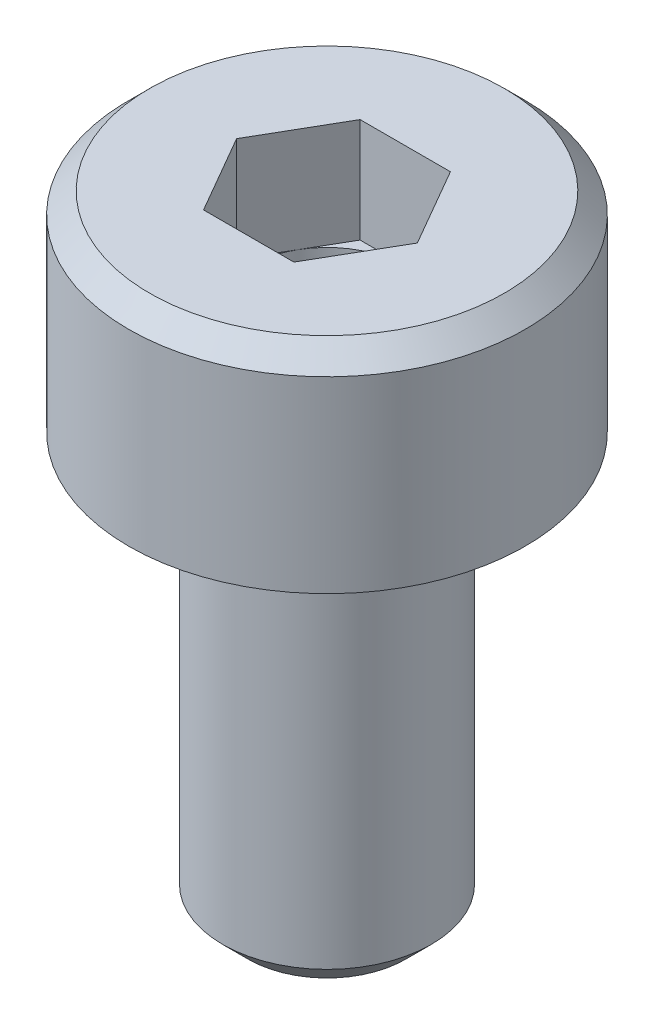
ISO-10303-21;
HEADER;
FILE_DESCRIPTION(('STEP AP214'),'2;1');
FILE_NAME('part.step','',(''),(''),'','','');
FILE_SCHEMA(('AUTOMOTIVE_DESIGN { 1 0 10303 214 1 1 1 1 }'));
ENDSEC;
DATA;
#1=APPLICATION_CONTEXT('core data for automotive mechanical design processes');
#2=APPLICATION_PROTOCOL_DEFINITION('international standard','automotive_design',2000,#1);
#3=PRODUCT_CONTEXT('',#1,'mechanical');
#4=PRODUCT('Part','Part','',(#3));
#5=PRODUCT_RELATED_PRODUCT_CATEGORY('part','',(#4));
#6=PRODUCT_DEFINITION_FORMATION('','',#4);
#7=PRODUCT_DEFINITION_CONTEXT('part definition',#1,'design');
#8=PRODUCT_DEFINITION('design','',#6,#7);
#9=PRODUCT_DEFINITION_SHAPE('','',#8);
#10=(LENGTH_UNIT() NAMED_UNIT(*) SI_UNIT(.MILLI.,.METRE.));
#11=(NAMED_UNIT(*) PLANE_ANGLE_UNIT() SI_UNIT($,.RADIAN.));
#12=(NAMED_UNIT(*) SI_UNIT($,.STERADIAN.) SOLID_ANGLE_UNIT());
#13=UNCERTAINTY_MEASURE_WITH_UNIT(LENGTH_MEASURE(1.E-05),#10,'distance_accuracy_value','');
#14=(GEOMETRIC_REPRESENTATION_CONTEXT(3) GLOBAL_UNCERTAINTY_ASSIGNED_CONTEXT((#13)) GLOBAL_UNIT_ASSIGNED_CONTEXT((#10,
#11,#12)) REPRESENTATION_CONTEXT('',''));
#15=CARTESIAN_POINT('',(0.,0.,0.));
#16=DIRECTION('',(0.,0.,1.));
#17=DIRECTION('',(1.,0.,0.));
#18=AXIS2_PLACEMENT_3D('',#15,#16,#17);
#19=CARTESIAN_POINT('',(0.,0.550000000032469,0.));
#20=DIRECTION('',(0.,1.,0.));
#21=DIRECTION('',(0.,0.,1.));
#22=AXIS2_PLACEMENT_3D('',#19,#20,#21);
#23=CONICAL_SURFACE('',#22,0.750000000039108,1.04719755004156);
#24=CARTESIAN_POINT('',(0.,0.116987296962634,0.));
#25=VERTEX_POINT('',#24);
#26=VERTEX_LOOP('',#25);
#27=FACE_BOUND('',#26,.T.);
#28=CARTESIAN_POINT('',(0.,0.55,0.));
#29=DIRECTION('',(0.,-1.,0.));
#30=DIRECTION('',(0.,0.,-1.));
#31=AXIS2_PLACEMENT_3D('',#28,#29,#30);
#32=CIRCLE('',#31,0.75);
#33=CARTESIAN_POINT('',(0.,0.55,-0.75));
#34=VERTEX_POINT('',#33);
#35=EDGE_CURVE('E98',#34,#34,#32,.F.);
#36=ORIENTED_EDGE('',*,*,#35,.T.);
#37=EDGE_LOOP('',(#36));
#38=FACE_BOUND('',#37,.T.);
#39=ADVANCED_FACE('F16',(#27,#38),#23,.F.);
#40=CARTESIAN_POINT('',(0.,2.,0.));
#41=DIRECTION('',(0.,-1.,0.));
#42=DIRECTION('',(0.,0.,-1.));
#43=AXIS2_PLACEMENT_3D('',#40,#41,#42);
#44=CYLINDRICAL_SURFACE('',#43,0.75);
#45=CARTESIAN_POINT('',(0.,1.,0.));
#46=DIRECTION('',(0.,-1.,0.));
#47=DIRECTION('',(0.,0.,-1.));
#48=AXIS2_PLACEMENT_3D('',#45,#46,#47);
#49=CIRCLE('',#48,0.75);
#50=CARTESIAN_POINT('',(0.,1.,-0.75));
#51=VERTEX_POINT('',#50);
#52=CARTESIAN_POINT('',(-0.649519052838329,1.,-0.375));
#53=VERTEX_POINT('',#52);
#54=EDGE_CURVE('E19',#51,#53,#49,.F.);
#55=ORIENTED_EDGE('',*,*,#54,.T.);
#56=CARTESIAN_POINT('',(0.,1.,0.));
#57=DIRECTION('',(0.,-1.,0.));
#58=DIRECTION('',(0.,0.,-1.));
#59=AXIS2_PLACEMENT_3D('',#56,#57,#58);
#60=CIRCLE('',#59,0.75);
#61=CARTESIAN_POINT('',(-0.649519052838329,1.,0.375));
#62=VERTEX_POINT('',#61);
#63=EDGE_CURVE('E93',#53,#62,#60,.F.);
#64=ORIENTED_EDGE('',*,*,#63,.T.);
#65=CARTESIAN_POINT('',(0.,1.,0.));
#66=DIRECTION('',(0.,-1.,0.));
#67=DIRECTION('',(0.,0.,-1.));
#68=AXIS2_PLACEMENT_3D('',#65,#66,#67);
#69=CIRCLE('',#68,0.75);
#70=CARTESIAN_POINT('',(0.,1.,0.75));
#71=VERTEX_POINT('',#70);
#72=EDGE_CURVE('E108',#62,#71,#69,.F.);
#73=ORIENTED_EDGE('',*,*,#72,.T.);
#74=CARTESIAN_POINT('',(0.,1.,0.));
#75=DIRECTION('',(0.,-1.,0.));
#76=DIRECTION('',(0.,0.,-1.));
#77=AXIS2_PLACEMENT_3D('',#74,#75,#76);
#78=CIRCLE('',#77,0.75);
#79=CARTESIAN_POINT('',(0.649519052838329,1.,0.375));
#80=VERTEX_POINT('',#79);
#81=EDGE_CURVE('E217',#71,#80,#78,.F.);
#82=ORIENTED_EDGE('',*,*,#81,.T.);
#83=CARTESIAN_POINT('',(0.,1.,0.));
#84=DIRECTION('',(0.,-1.,0.));
#85=DIRECTION('',(0.,0.,-1.));
#86=AXIS2_PLACEMENT_3D('',#83,#84,#85);
#87=CIRCLE('',#86,0.75);
#88=CARTESIAN_POINT('',(0.649519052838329,1.,-0.375));
#89=VERTEX_POINT('',#88);
#90=EDGE_CURVE('E219',#80,#89,#87,.F.);
#91=ORIENTED_EDGE('',*,*,#90,.T.);
#92=CARTESIAN_POINT('',(0.,1.,0.));
#93=DIRECTION('',(0.,-1.,0.));
#94=DIRECTION('',(0.,0.,-1.));
#95=AXIS2_PLACEMENT_3D('',#92,#93,#94);
#96=CIRCLE('',#95,0.75);
#97=EDGE_CURVE('E88',#89,#51,#96,.F.);
#98=ORIENTED_EDGE('',*,*,#97,.T.);
#99=EDGE_LOOP('',(#55,#64,#73,#82,#91,#98));
#100=FACE_BOUND('',#99,.T.);
#101=ORIENTED_EDGE('',*,*,#35,.F.);
#102=EDGE_LOOP('',(#101));
#103=FACE_BOUND('',#102,.T.);
#104=ADVANCED_FACE('F91',(#100,#103),#44,.F.);
#105=CARTESIAN_POINT('',(0.,1.,0.));
#106=DIRECTION('',(0.,-1.,0.));
#107=DIRECTION('',(0.,0.,-1.));
#108=AXIS2_PLACEMENT_3D('',#105,#106,#107);
#109=PLANE('',#108);
#110=DIRECTION('',(-0.5,0.,0.866025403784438));
#111=VECTOR('',#110,1.);
#112=CARTESIAN_POINT('',(-0.649519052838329,1.,-0.375));
#113=LINE('',#112,#111);
#114=CARTESIAN_POINT('',(-0.433012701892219,1.,-0.75));
#115=VERTEX_POINT('',#114);
#116=EDGE_CURVE('E111',#115,#53,#113,.T.);
#117=ORIENTED_EDGE('',*,*,#116,.T.);
#118=ORIENTED_EDGE('',*,*,#54,.F.);
#119=DIRECTION('',(-1.,0.,0.));
#120=VECTOR('',#119,1.);
#121=CARTESIAN_POINT('',(0.,1.,-0.75));
#122=LINE('',#121,#120);
#123=EDGE_CURVE('E114',#51,#115,#122,.T.);
#124=ORIENTED_EDGE('',*,*,#123,.T.);
#125=EDGE_LOOP('',(#117,#118,#124));
#126=FACE_BOUND('',#125,.T.);
#127=ADVANCED_FACE('F112',(#126),#109,.F.);
#128=CARTESIAN_POINT('',(0.,1.,0.));
#129=DIRECTION('',(0.,-1.,0.));
#130=DIRECTION('',(0.,0.,-1.));
#131=AXIS2_PLACEMENT_3D('',#128,#129,#130);
#132=PLANE('',#131);
#133=DIRECTION('',(-1.,0.,0.));
#134=VECTOR('',#133,1.);
#135=CARTESIAN_POINT('',(0.,1.,-0.75));
#136=LINE('',#135,#134);
#137=CARTESIAN_POINT('',(0.43301270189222,1.,-0.75));
#138=VERTEX_POINT('',#137);
#139=EDGE_CURVE('E183',#138,#51,#136,.T.);
#140=ORIENTED_EDGE('',*,*,#139,.T.);
#141=ORIENTED_EDGE('',*,*,#97,.F.);
#142=DIRECTION('',(0.5,0.,0.866025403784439));
#143=VECTOR('',#142,1.);
#144=CARTESIAN_POINT('',(0.649519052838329,1.,-0.375));
#145=LINE('',#144,#143);
#146=EDGE_CURVE('E174',#138,#89,#145,.T.);
#147=ORIENTED_EDGE('',*,*,#146,.F.);
#148=EDGE_LOOP('',(#140,#141,#147));
#149=FACE_BOUND('',#148,.T.);
#150=ADVANCED_FACE('F226',(#149),#132,.F.);
#151=CARTESIAN_POINT('',(0.,1.,0.));
#152=DIRECTION('',(0.,-1.,0.));
#153=DIRECTION('',(0.,0.,-1.));
#154=AXIS2_PLACEMENT_3D('',#151,#152,#153);
#155=PLANE('',#154);
#156=DIRECTION('',(0.5,0.,0.866025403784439));
#157=VECTOR('',#156,1.);
#158=CARTESIAN_POINT('',(0.649519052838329,1.,-0.375));
#159=LINE('',#158,#157);
#160=CARTESIAN_POINT('',(0.866025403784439,1.,0.));
#161=VERTEX_POINT('',#160);
#162=EDGE_CURVE('E171',#89,#161,#159,.T.);
#163=ORIENTED_EDGE('',*,*,#162,.F.);
#164=ORIENTED_EDGE('',*,*,#90,.F.);
#165=DIRECTION('',(-0.5,0.,0.866025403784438));
#166=VECTOR('',#165,1.);
#167=CARTESIAN_POINT('',(0.649519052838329,1.,0.375));
#168=LINE('',#167,#166);
#169=EDGE_CURVE('E159',#161,#80,#168,.T.);
#170=ORIENTED_EDGE('',*,*,#169,.F.);
#171=EDGE_LOOP('',(#163,#164,#170));
#172=FACE_BOUND('',#171,.T.);
#173=ADVANCED_FACE('F228',(#172),#155,.F.);
#174=CARTESIAN_POINT('',(0.,1.,0.));
#175=DIRECTION('',(0.,-1.,0.));
#176=DIRECTION('',(0.,0.,-1.));
#177=AXIS2_PLACEMENT_3D('',#174,#175,#176);
#178=PLANE('',#177);
#179=DIRECTION('',(-0.5,0.,0.866025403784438));
#180=VECTOR('',#179,1.);
#181=CARTESIAN_POINT('',(0.649519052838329,1.,0.375));
#182=LINE('',#181,#180);
#183=CARTESIAN_POINT('',(0.433012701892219,1.,0.75));
#184=VERTEX_POINT('',#183);
#185=EDGE_CURVE('E156',#80,#184,#182,.T.);
#186=ORIENTED_EDGE('',*,*,#185,.F.);
#187=ORIENTED_EDGE('',*,*,#81,.F.);
#188=DIRECTION('',(-1.,0.,0.));
#189=VECTOR('',#188,1.);
#190=CARTESIAN_POINT('',(0.,1.,0.75));
#191=LINE('',#190,#189);
#192=EDGE_CURVE('E144',#184,#71,#191,.T.);
#193=ORIENTED_EDGE('',*,*,#192,.F.);
#194=EDGE_LOOP('',(#186,#187,#193));
#195=FACE_BOUND('',#194,.T.);
#196=ADVANCED_FACE('F265',(#195),#178,.F.);
#197=CARTESIAN_POINT('',(0.,1.,0.));
#198=DIRECTION('',(0.,-1.,0.));
#199=DIRECTION('',(0.,0.,-1.));
#200=AXIS2_PLACEMENT_3D('',#197,#198,#199);
#201=PLANE('',#200);
#202=DIRECTION('',(-1.,0.,0.));
#203=VECTOR('',#202,1.);
#204=CARTESIAN_POINT('',(0.,1.,0.75));
#205=LINE('',#204,#203);
#206=CARTESIAN_POINT('',(-0.433012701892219,1.,0.75));
#207=VERTEX_POINT('',#206);
#208=EDGE_CURVE('E141',#71,#207,#205,.T.);
#209=ORIENTED_EDGE('',*,*,#208,.F.);
#210=ORIENTED_EDGE('',*,*,#72,.F.);
#211=DIRECTION('',(0.5,0.,0.866025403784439));
#212=VECTOR('',#211,1.);
#213=CARTESIAN_POINT('',(-0.649519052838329,1.,0.375));
#214=LINE('',#213,#212);
#215=EDGE_CURVE('E148',#62,#207,#214,.T.);
#216=ORIENTED_EDGE('',*,*,#215,.T.);
#217=EDGE_LOOP('',(#209,#210,#216));
#218=FACE_BOUND('',#217,.T.);
#219=ADVANCED_FACE('F262',(#218),#201,.F.);
#220=CARTESIAN_POINT('',(0.,1.,0.));
#221=DIRECTION('',(0.,-1.,0.));
#222=DIRECTION('',(0.,0.,-1.));
#223=AXIS2_PLACEMENT_3D('',#220,#221,#222);
#224=PLANE('',#223);
#225=DIRECTION('',(0.5,0.,0.866025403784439));
#226=VECTOR('',#225,1.);
#227=CARTESIAN_POINT('',(-0.649519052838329,1.,0.375));
#228=LINE('',#227,#226);
#229=CARTESIAN_POINT('',(-0.866025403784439,1.,0.));
#230=VERTEX_POINT('',#229);
#231=EDGE_CURVE('E106',#230,#62,#228,.T.);
#232=ORIENTED_EDGE('',*,*,#231,.T.);
#233=ORIENTED_EDGE('',*,*,#63,.F.);
#234=DIRECTION('',(-0.5,0.,0.866025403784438));
#235=VECTOR('',#234,1.);
#236=CARTESIAN_POINT('',(-0.649519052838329,1.,-0.375));
#237=LINE('',#236,#235);
#238=EDGE_CURVE('E103',#53,#230,#237,.T.);
#239=ORIENTED_EDGE('',*,*,#238,.T.);
#240=EDGE_LOOP('',(#232,#233,#239));
#241=FACE_BOUND('',#240,.T.);
#242=ADVANCED_FACE('F101',(#241),#224,.F.);
#243=CARTESIAN_POINT('',(-0.649519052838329,1.5,-0.375));
#244=DIRECTION('',(-0.866025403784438,0.,-0.5));
#245=DIRECTION('',(-0.5,0.,0.866025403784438));
#246=AXIS2_PLACEMENT_3D('',#243,#244,#245);
#247=PLANE('',#246);
#248=DIRECTION('',(0.,1.,0.));
#249=VECTOR('',#248,1.);
#250=CARTESIAN_POINT('',(-0.433012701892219,2.,-0.75));
#251=LINE('',#250,#249);
#252=CARTESIAN_POINT('',(-0.433012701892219,2.,-0.75));
#253=VERTEX_POINT('',#252);
#254=EDGE_CURVE('E187',#115,#253,#251,.T.);
#255=ORIENTED_EDGE('',*,*,#254,.T.);
#256=DIRECTION('',(0.500000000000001,0.,-0.866025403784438));
#257=VECTOR('',#256,1.);
#258=CARTESIAN_POINT('',(-0.866025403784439,2.,0.));
#259=LINE('',#258,#257);
#260=CARTESIAN_POINT('',(-0.866025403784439,2.,0.));
#261=VERTEX_POINT('',#260);
#262=EDGE_CURVE('E128',#261,#253,#259,.T.);
#263=ORIENTED_EDGE('',*,*,#262,.F.);
#264=DIRECTION('',(0.,1.,0.));
#265=VECTOR('',#264,1.);
#266=CARTESIAN_POINT('',(-0.866025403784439,1.5,0.));
#267=LINE('',#266,#265);
#268=EDGE_CURVE('E120',#261,#230,#267,.F.);
#269=ORIENTED_EDGE('',*,*,#268,.T.);
#270=ORIENTED_EDGE('',*,*,#238,.F.);
#271=ORIENTED_EDGE('',*,*,#116,.F.);
#272=EDGE_LOOP('',(#255,#263,#269,#270,#271));
#273=FACE_BOUND('',#272,.T.);
#274=ADVANCED_FACE('F118',(#273),#247,.F.);
#275=CARTESIAN_POINT('',(0.,2.,-0.75));
#276=DIRECTION('',(0.,0.,-1.));
#277=DIRECTION('',(-1.,0.,0.));
#278=AXIS2_PLACEMENT_3D('',#275,#276,#277);
#279=PLANE('',#278);
#280=DIRECTION('',(0.,1.,0.));
#281=VECTOR('',#280,1.);
#282=CARTESIAN_POINT('',(0.43301270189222,1.5,-0.75));
#283=LINE('',#282,#281);
#284=CARTESIAN_POINT('',(0.43301270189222,2.,-0.75));
#285=VERTEX_POINT('',#284);
#286=EDGE_CURVE('E168',#285,#138,#283,.F.);
#287=ORIENTED_EDGE('',*,*,#286,.F.);
#288=DIRECTION('',(1.,0.,0.));
#289=VECTOR('',#288,1.);
#290=CARTESIAN_POINT('',(0.,2.,-0.75));
#291=LINE('',#290,#289);
#292=EDGE_CURVE('E131',#253,#285,#291,.T.);
#293=ORIENTED_EDGE('',*,*,#292,.F.);
#294=ORIENTED_EDGE('',*,*,#254,.F.);
#295=ORIENTED_EDGE('',*,*,#123,.F.);
#296=ORIENTED_EDGE('',*,*,#139,.F.);
#297=EDGE_LOOP('',(#287,#293,#294,#295,#296));
#298=FACE_BOUND('',#297,.T.);
#299=ADVANCED_FACE('F237',(#298),#279,.F.);
#300=CARTESIAN_POINT('',(0.649519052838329,1.5,-0.375));
#301=DIRECTION('',(-0.866025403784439,0.,0.5));
#302=DIRECTION('',(0.5,0.,0.866025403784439));
#303=AXIS2_PLACEMENT_3D('',#300,#301,#302);
#304=PLANE('',#303);
#305=DIRECTION('',(0.5,0.,0.866025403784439));
#306=VECTOR('',#305,1.);
#307=CARTESIAN_POINT('',(0.43301270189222,2.,-0.75));
#308=LINE('',#307,#306);
#309=CARTESIAN_POINT('',(0.866025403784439,2.,0.));
#310=VERTEX_POINT('',#309);
#311=EDGE_CURVE('E233',#285,#310,#308,.T.);
#312=ORIENTED_EDGE('',*,*,#311,.F.);
#313=ORIENTED_EDGE('',*,*,#286,.T.);
#314=ORIENTED_EDGE('',*,*,#146,.T.);
#315=ORIENTED_EDGE('',*,*,#162,.T.);
#316=DIRECTION('',(0.,1.,0.));
#317=VECTOR('',#316,1.);
#318=CARTESIAN_POINT('',(0.866025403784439,1.5,0.));
#319=LINE('',#318,#317);
#320=EDGE_CURVE('E153',#310,#161,#319,.F.);
#321=ORIENTED_EDGE('',*,*,#320,.F.);
#322=EDGE_LOOP('',(#312,#313,#314,#315,#321));
#323=FACE_BOUND('',#322,.T.);
#324=ADVANCED_FACE('F231',(#323),#304,.T.);
#325=CARTESIAN_POINT('',(0.649519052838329,1.5,0.375));
#326=DIRECTION('',(-0.866025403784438,0.,-0.5));
#327=DIRECTION('',(-0.5,0.,0.866025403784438));
#328=AXIS2_PLACEMENT_3D('',#325,#326,#327);
#329=PLANE('',#328);
#330=DIRECTION('',(-0.500000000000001,0.,0.866025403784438));
#331=VECTOR('',#330,1.);
#332=CARTESIAN_POINT('',(0.866025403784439,2.,0.));
#333=LINE('',#332,#331);
#334=CARTESIAN_POINT('',(0.433012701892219,2.,0.75));
#335=VERTEX_POINT('',#334);
#336=EDGE_CURVE('E246',#310,#335,#333,.T.);
#337=ORIENTED_EDGE('',*,*,#336,.F.);
#338=ORIENTED_EDGE('',*,*,#320,.T.);
#339=ORIENTED_EDGE('',*,*,#169,.T.);
#340=ORIENTED_EDGE('',*,*,#185,.T.);
#341=DIRECTION('',(0.,1.,0.));
#342=VECTOR('',#341,1.);
#343=CARTESIAN_POINT('',(0.433012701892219,2.,0.75));
#344=LINE('',#343,#342);
#345=EDGE_CURVE('E143',#335,#184,#344,.F.);
#346=ORIENTED_EDGE('',*,*,#345,.F.);
#347=EDGE_LOOP('',(#337,#338,#339,#340,#346));
#348=FACE_BOUND('',#347,.T.);
#349=ADVANCED_FACE('F267',(#348),#329,.T.);
#350=CARTESIAN_POINT('',(0.,2.,0.75));
#351=DIRECTION('',(0.,0.,-1.));
#352=DIRECTION('',(-1.,0.,0.));
#353=AXIS2_PLACEMENT_3D('',#350,#351,#352);
#354=PLANE('',#353);
#355=DIRECTION('',(1.,0.,0.));
#356=VECTOR('',#355,1.);
#357=CARTESIAN_POINT('',(0.,2.,0.75));
#358=LINE('',#357,#356);
#359=CARTESIAN_POINT('',(-0.433012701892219,2.,0.75));
#360=VERTEX_POINT('',#359);
#361=EDGE_CURVE('E138',#335,#360,#358,.F.);
#362=ORIENTED_EDGE('',*,*,#361,.F.);
#363=ORIENTED_EDGE('',*,*,#345,.T.);
#364=ORIENTED_EDGE('',*,*,#192,.T.);
#365=ORIENTED_EDGE('',*,*,#208,.T.);
#366=DIRECTION('',(0.,1.,0.));
#367=VECTOR('',#366,1.);
#368=CARTESIAN_POINT('',(-0.433012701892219,1.5,0.75));
#369=LINE('',#368,#367);
#370=EDGE_CURVE('E34',#207,#360,#369,.T.);
#371=ORIENTED_EDGE('',*,*,#370,.T.);
#372=EDGE_LOOP('',(#362,#363,#364,#365,#371));
#373=FACE_BOUND('',#372,.T.);
#374=ADVANCED_FACE('F263',(#373),#354,.T.);
#375=CARTESIAN_POINT('',(-0.649519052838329,1.5,0.375));
#376=DIRECTION('',(-0.866025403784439,0.,0.5));
#377=DIRECTION('',(0.5,0.,0.866025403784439));
#378=AXIS2_PLACEMENT_3D('',#375,#376,#377);
#379=PLANE('',#378);
#380=ORIENTED_EDGE('',*,*,#268,.F.);
#381=DIRECTION('',(-0.500000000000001,0.,-0.866025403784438));
#382=VECTOR('',#381,1.);
#383=CARTESIAN_POINT('',(-0.433012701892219,2.,0.75));
#384=LINE('',#383,#382);
#385=EDGE_CURVE('E134',#360,#261,#384,.T.);
#386=ORIENTED_EDGE('',*,*,#385,.F.);
#387=ORIENTED_EDGE('',*,*,#370,.F.);
#388=ORIENTED_EDGE('',*,*,#215,.F.);
#389=ORIENTED_EDGE('',*,*,#231,.F.);
#390=EDGE_LOOP('',(#380,#386,#387,#388,#389));
#391=FACE_BOUND('',#390,.T.);
#392=ADVANCED_FACE('F240',(#391),#379,.F.);
#393=CARTESIAN_POINT('',(0.,2.,0.));
#394=DIRECTION('',(0.,1.,0.));
#395=DIRECTION('',(0.,0.,1.));
#396=AXIS2_PLACEMENT_3D('',#393,#394,#395);
#397=PLANE('',#396);
#398=ORIENTED_EDGE('',*,*,#361,.T.);
#399=ORIENTED_EDGE('',*,*,#385,.T.);
#400=ORIENTED_EDGE('',*,*,#262,.T.);
#401=ORIENTED_EDGE('',*,*,#292,.T.);
#402=ORIENTED_EDGE('',*,*,#311,.T.);
#403=ORIENTED_EDGE('',*,*,#336,.T.);
#404=EDGE_LOOP('',(#398,#399,#400,#401,#402,#403));
#405=FACE_BOUND('',#404,.T.);
#406=CARTESIAN_POINT('',(0.,2.00000000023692,0.));
#407=DIRECTION('',(0.,-1.,0.));
#408=DIRECTION('',(0.,0.,-1.));
#409=AXIS2_PLACEMENT_3D('',#406,#407,#408);
#410=CIRCLE('',#409,1.7000000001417);
#411=CARTESIAN_POINT('',(0.,2.00000000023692,-1.7000000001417));
#412=VERTEX_POINT('',#411);
#413=EDGE_CURVE('E137',#412,#412,#410,.T.);
#414=ORIENTED_EDGE('',*,*,#413,.F.);
#415=EDGE_LOOP('',(#414));
#416=FACE_BOUND('',#415,.T.);
#417=ADVANCED_FACE('F242',(#405,#416),#397,.T.);
#418=CARTESIAN_POINT('',(0.,1.80000000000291,0.));
#419=DIRECTION('',(0.,-1.,0.));
#420=DIRECTION('',(0.,0.,-1.));
#421=AXIS2_PLACEMENT_3D('',#418,#419,#420);
#422=CONICAL_SURFACE('',#421,1.90000000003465,0.785398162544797);
#423=CARTESIAN_POINT('',(0.,1.8,0.));
#424=DIRECTION('',(0.,1.,0.));
#425=DIRECTION('',(0.,0.,1.));
#426=AXIS2_PLACEMENT_3D('',#423,#424,#425);
#427=CIRCLE('',#426,1.9);
#428=CARTESIAN_POINT('',(0.,1.8,1.9));
#429=VERTEX_POINT('',#428);
#430=EDGE_CURVE('E213',#429,#429,#427,.F.);
#431=ORIENTED_EDGE('',*,*,#430,.F.);
#432=EDGE_LOOP('',(#431));
#433=FACE_BOUND('',#432,.T.);
#434=ORIENTED_EDGE('',*,*,#413,.T.);
#435=EDGE_LOOP('',(#434));
#436=FACE_BOUND('',#435,.T.);
#437=ADVANCED_FACE('F323',(#433,#436),#422,.T.);
#438=CARTESIAN_POINT('',(0.,0.,0.));
#439=DIRECTION('',(0.,1.,0.));
#440=DIRECTION('',(0.,0.,1.));
#441=AXIS2_PLACEMENT_3D('',#438,#439,#440);
#442=CYLINDRICAL_SURFACE('',#441,1.9);
#443=CARTESIAN_POINT('',(0.,0.,0.));
#444=DIRECTION('',(0.,1.,0.));
#445=DIRECTION('',(0.,0.,1.));
#446=AXIS2_PLACEMENT_3D('',#443,#444,#445);
#447=CIRCLE('',#446,1.9);
#448=CARTESIAN_POINT('',(0.,0.,1.9));
#449=VERTEX_POINT('',#448);
#450=EDGE_CURVE('E210',#449,#449,#447,.F.);
#451=ORIENTED_EDGE('',*,*,#450,.F.);
#452=EDGE_LOOP('',(#451));
#453=FACE_BOUND('',#452,.T.);
#454=ORIENTED_EDGE('',*,*,#430,.T.);
#455=EDGE_LOOP('',(#454));
#456=FACE_BOUND('',#455,.T.);
#457=ADVANCED_FACE('F319',(#453,#456),#442,.T.);
#458=CARTESIAN_POINT('',(0.,-4.,0.));
#459=DIRECTION('',(0.,-1.,0.));
#460=DIRECTION('',(0.,0.,-1.));
#461=AXIS2_PLACEMENT_3D('',#458,#459,#460);
#462=PLANE('',#461);
#463=CARTESIAN_POINT('',(0.,-3.99999999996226,0.));
#464=DIRECTION('',(0.,1.,0.));
#465=DIRECTION('',(0.,0.,1.));
#466=AXIS2_PLACEMENT_3D('',#463,#464,#465);
#467=CIRCLE('',#466,0.754620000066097);
#468=CARTESIAN_POINT('',(0.,-3.99999999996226,0.754620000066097));
#469=VERTEX_POINT('',#468);
#470=EDGE_CURVE('E206',#469,#469,#467,.T.);
#471=ORIENTED_EDGE('',*,*,#470,.F.);
#472=EDGE_LOOP('',(#471));
#473=FACE_BOUND('',#472,.T.);
#474=ADVANCED_FACE('F315',(#473),#462,.T.);
#475=CARTESIAN_POINT('',(0.,0.,0.));
#476=DIRECTION('',(0.,-1.,0.));
#477=DIRECTION('',(0.,0.,-1.));
#478=AXIS2_PLACEMENT_3D('',#475,#476,#477);
#479=PLANE('',#478);
#480=ORIENTED_EDGE('',*,*,#450,.T.);
#481=EDGE_LOOP('',(#480));
#482=FACE_BOUND('',#481,.T.);
#483=CARTESIAN_POINT('',(0.,0.,0.));
#484=DIRECTION('',(0.,-1.,0.));
#485=DIRECTION('',(0.,0.,-1.));
#486=AXIS2_PLACEMENT_3D('',#483,#484,#485);
#487=CIRCLE('',#486,1.1);
#488=CARTESIAN_POINT('',(0.,0.,-1.1));
#489=VERTEX_POINT('',#488);
#490=EDGE_CURVE('E209',#489,#489,#487,.F.);
#491=ORIENTED_EDGE('',*,*,#490,.T.);
#492=EDGE_LOOP('',(#491));
#493=FACE_BOUND('',#492,.T.);
#494=ADVANCED_FACE('F306',(#482,#493),#479,.T.);
#495=CARTESIAN_POINT('',(0.,-3.75461999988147,0.));
#496=DIRECTION('',(0.,1.,0.));
#497=DIRECTION('',(0.,0.,1.));
#498=AXIS2_PLACEMENT_3D('',#495,#496,#497);
#499=CONICAL_SURFACE('',#498,0.999999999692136,0.78539816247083);
#500=ORIENTED_EDGE('',*,*,#470,.T.);
#501=EDGE_LOOP('',(#500));
#502=FACE_BOUND('',#501,.T.);
#503=CARTESIAN_POINT('',(0.,-3.75462,0.));
#504=DIRECTION('',(0.,-1.,0.));
#505=DIRECTION('',(0.,0.,-1.));
#506=AXIS2_PLACEMENT_3D('',#503,#504,#505);
#507=CIRCLE('',#506,1.);
#508=CARTESIAN_POINT('',(0.,-3.75462,-1.));
#509=VERTEX_POINT('',#508);
#510=EDGE_CURVE('E25',#509,#509,#507,.F.);
#511=ORIENTED_EDGE('',*,*,#510,.F.);
#512=EDGE_LOOP('',(#511));
#513=FACE_BOUND('',#512,.T.);
#514=ADVANCED_FACE('F285',(#502,#513),#499,.T.);
#515=CARTESIAN_POINT('',(0.,-0.1,0.));
#516=DIRECTION('',(0.,-1.,0.));
#517=DIRECTION('',(0.,0.,1.));
#518=AXIS2_PLACEMENT_3D('',#515,#516,#517);
#519=TOROIDAL_SURFACE('',#518,1.1,0.1);
#520=CARTESIAN_POINT('',(0.,-0.1,0.));
#521=DIRECTION('',(0.,-1.,0.));
#522=DIRECTION('',(0.,0.,-1.));
#523=AXIS2_PLACEMENT_3D('',#520,#521,#522);
#524=CIRCLE('',#523,1.);
#525=CARTESIAN_POINT('',(0.,-0.1,-1.));
#526=VERTEX_POINT('',#525);
#527=EDGE_CURVE('E11',#526,#526,#524,.T.);
#528=ORIENTED_EDGE('',*,*,#527,.F.);
#529=EDGE_LOOP('',(#528));
#530=FACE_BOUND('',#529,.T.);
#531=ORIENTED_EDGE('',*,*,#490,.F.);
#532=EDGE_LOOP('',(#531));
#533=FACE_BOUND('',#532,.T.);
#534=ADVANCED_FACE('F279',(#530,#533),#519,.F.);
#535=CARTESIAN_POINT('',(0.,0.,0.));
#536=DIRECTION('',(0.,-1.,0.));
#537=DIRECTION('',(0.,0.,-1.));
#538=AXIS2_PLACEMENT_3D('',#535,#536,#537);
#539=CYLINDRICAL_SURFACE('',#538,1.);
#540=ORIENTED_EDGE('',*,*,#527,.T.);
#541=EDGE_LOOP('',(#540));
#542=FACE_BOUND('',#541,.T.);
#543=ORIENTED_EDGE('',*,*,#510,.T.);
#544=EDGE_LOOP('',(#543));
#545=FACE_BOUND('',#544,.T.);
#546=ADVANCED_FACE('F277',(#542,#545),#539,.T.);
#547=CLOSED_SHELL('',(#39,#104,#127,#150,#173,#196,#219,#242,#274,#299,#324,#349,#374,#392,#417,
#437,#457,#474,#494,#514,#534,#546));
#548=MANIFOLD_SOLID_BREP('B1',#547);
#549=ADVANCED_BREP_SHAPE_REPRESENTATION('',(#18,#548),#14);
#550=SHAPE_DEFINITION_REPRESENTATION(#9,#549);
ENDSEC;
END-ISO-10303-21;
